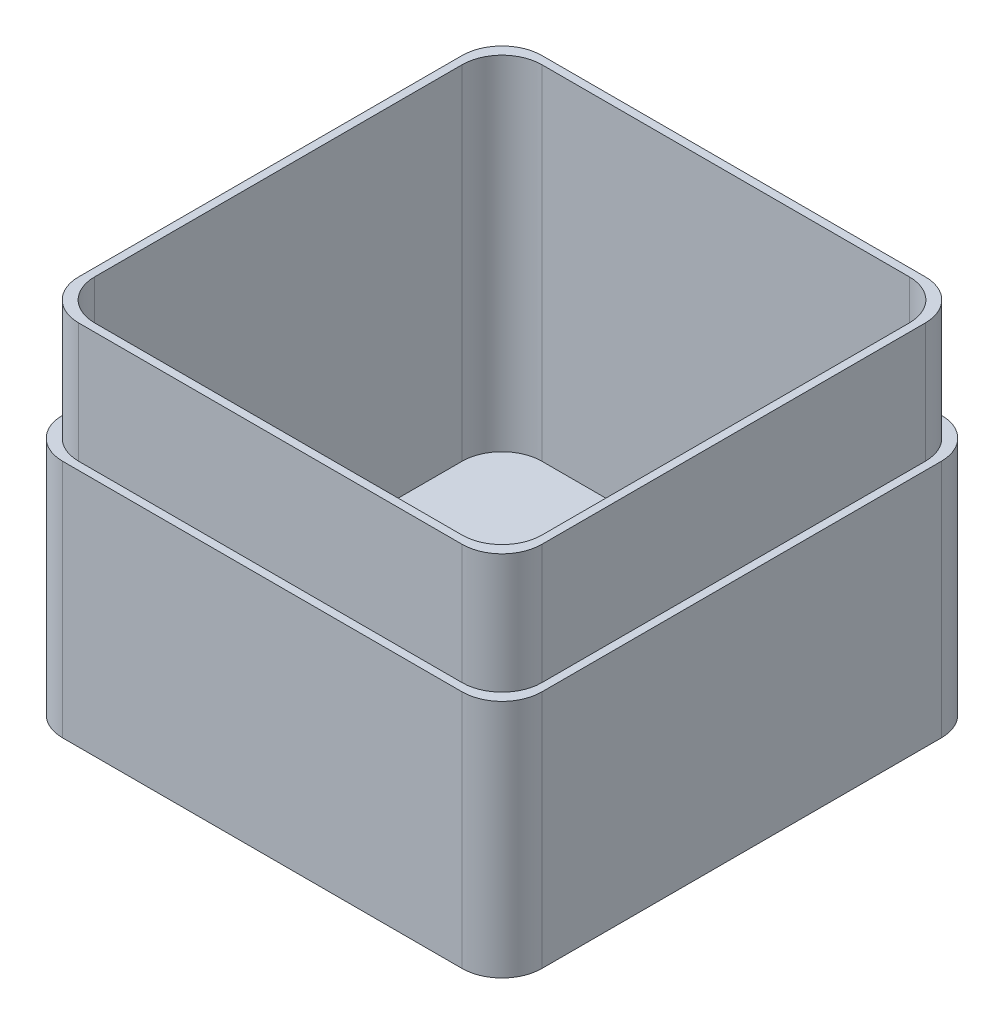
ISO-10303-21;
HEADER;
FILE_DESCRIPTION(('STEP AP214'),'2;1');
FILE_NAME('part.step','',(''),(''),'','','');
FILE_SCHEMA(('AUTOMOTIVE_DESIGN { 1 0 10303 214 1 1 1 1 }'));
ENDSEC;
DATA;
#1=APPLICATION_CONTEXT('core data for automotive mechanical design processes');
#2=APPLICATION_PROTOCOL_DEFINITION('international standard','automotive_design',2000,#1);
#3=PRODUCT_CONTEXT('',#1,'mechanical');
#4=PRODUCT('Part','Part','',(#3));
#5=PRODUCT_RELATED_PRODUCT_CATEGORY('part','',(#4));
#6=PRODUCT_DEFINITION_FORMATION('','',#4);
#7=PRODUCT_DEFINITION_CONTEXT('part definition',#1,'design');
#8=PRODUCT_DEFINITION('design','',#6,#7);
#9=PRODUCT_DEFINITION_SHAPE('','',#8);
#10=(LENGTH_UNIT() NAMED_UNIT(*) SI_UNIT(.MILLI.,.METRE.));
#11=(NAMED_UNIT(*) PLANE_ANGLE_UNIT() SI_UNIT($,.RADIAN.));
#12=(NAMED_UNIT(*) SI_UNIT($,.STERADIAN.) SOLID_ANGLE_UNIT());
#13=UNCERTAINTY_MEASURE_WITH_UNIT(LENGTH_MEASURE(1.E-05),#10,'distance_accuracy_value','');
#14=(GEOMETRIC_REPRESENTATION_CONTEXT(3) GLOBAL_UNCERTAINTY_ASSIGNED_CONTEXT((#13)) GLOBAL_UNIT_ASSIGNED_CONTEXT((#10,
#11,#12)) REPRESENTATION_CONTEXT('',''));
#15=CARTESIAN_POINT('',(0.,0.,0.));
#16=DIRECTION('',(0.,0.,1.));
#17=DIRECTION('',(1.,0.,0.));
#18=AXIS2_PLACEMENT_3D('',#15,#16,#17);
#19=CARTESIAN_POINT('',(0.,90.,0.));
#20=DIRECTION('',(0.,1.,0.));
#21=DIRECTION('',(0.,0.,1.));
#22=AXIS2_PLACEMENT_3D('',#19,#20,#21);
#23=PLANE('',#22);
#24=DIRECTION('',(0.,0.,-1.));
#25=VECTOR('',#24,1.);
#26=CARTESIAN_POINT('',(56.,90.,-60.));
#27=LINE('',#26,#25);
#28=CARTESIAN_POINT('',(56.,90.,46.));
#29=VERTEX_POINT('',#28);
#30=CARTESIAN_POINT('',(56.,90.,-46.));
#31=VERTEX_POINT('',#30);
#32=EDGE_CURVE('E472',#29,#31,#27,.T.);
#33=ORIENTED_EDGE('',*,*,#32,.F.);
#34=CARTESIAN_POINT('',(46.,90.,46.));
#35=DIRECTION('',(0.,1.,0.));
#36=DIRECTION('',(0.,0.,1.));
#37=AXIS2_PLACEMENT_3D('',#34,#35,#36);
#38=CIRCLE('',#37,10.);
#39=CARTESIAN_POINT('',(46.,90.,56.));
#40=VERTEX_POINT('',#39);
#41=EDGE_CURVE('E364',#29,#40,#38,.F.);
#42=ORIENTED_EDGE('',*,*,#41,.T.);
#43=DIRECTION('',(1.,0.,0.));
#44=VECTOR('',#43,1.);
#45=CARTESIAN_POINT('',(-60.,90.,56.));
#46=LINE('',#45,#44);
#47=CARTESIAN_POINT('',(-46.,90.,56.));
#48=VERTEX_POINT('',#47);
#49=EDGE_CURVE('E435',#48,#40,#46,.T.);
#50=ORIENTED_EDGE('',*,*,#49,.F.);
#51=CARTESIAN_POINT('',(-46.,90.,46.));
#52=DIRECTION('',(0.,1.,0.));
#53=DIRECTION('',(0.,0.,1.));
#54=AXIS2_PLACEMENT_3D('',#51,#52,#53);
#55=CIRCLE('',#54,10.);
#56=CARTESIAN_POINT('',(-56.,90.,46.));
#57=VERTEX_POINT('',#56);
#58=EDGE_CURVE('E361',#48,#57,#55,.F.);
#59=ORIENTED_EDGE('',*,*,#58,.T.);
#60=DIRECTION('',(0.,0.,1.));
#61=VECTOR('',#60,1.);
#62=CARTESIAN_POINT('',(-56.,90.,-60.));
#63=LINE('',#62,#61);
#64=CARTESIAN_POINT('',(-56.,90.,-46.));
#65=VERTEX_POINT('',#64);
#66=EDGE_CURVE('E442',#65,#57,#63,.T.);
#67=ORIENTED_EDGE('',*,*,#66,.F.);
#68=CARTESIAN_POINT('',(-46.,90.,-46.));
#69=DIRECTION('',(0.,1.,0.));
#70=DIRECTION('',(0.,0.,1.));
#71=AXIS2_PLACEMENT_3D('',#68,#69,#70);
#72=CIRCLE('',#71,10.);
#73=CARTESIAN_POINT('',(-46.,90.,-56.));
#74=VERTEX_POINT('',#73);
#75=EDGE_CURVE('E85',#65,#74,#72,.F.);
#76=ORIENTED_EDGE('',*,*,#75,.T.);
#77=DIRECTION('',(-1.,0.,0.));
#78=VECTOR('',#77,1.);
#79=CARTESIAN_POINT('',(-60.,90.,-56.));
#80=LINE('',#79,#78);
#81=CARTESIAN_POINT('',(46.,90.,-56.));
#82=VERTEX_POINT('',#81);
#83=EDGE_CURVE('E476',#82,#74,#80,.T.);
#84=ORIENTED_EDGE('',*,*,#83,.F.);
#85=CARTESIAN_POINT('',(46.,90.,-46.));
#86=DIRECTION('',(0.,1.,0.));
#87=DIRECTION('',(0.,0.,1.));
#88=AXIS2_PLACEMENT_3D('',#85,#86,#87);
#89=CIRCLE('',#88,10.);
#90=EDGE_CURVE('E381',#82,#31,#89,.F.);
#91=ORIENTED_EDGE('',*,*,#90,.T.);
#92=EDGE_LOOP('',(#33,#42,#50,#59,#67,#76,#84,#91));
#93=FACE_BOUND('',#92,.T.);
#94=DIRECTION('',(-1.,0.,0.));
#95=VECTOR('',#94,1.);
#96=CARTESIAN_POINT('',(-58.,90.,-58.));
#97=LINE('',#96,#95);
#98=CARTESIAN_POINT('',(48.,90.,-58.));
#99=VERTEX_POINT('',#98);
#100=CARTESIAN_POINT('',(-48.,90.,-58.));
#101=VERTEX_POINT('',#100);
#102=EDGE_CURVE('E505',#99,#101,#97,.T.);
#103=ORIENTED_EDGE('',*,*,#102,.T.);
#104=CARTESIAN_POINT('',(-48.,90.,-48.));
#105=DIRECTION('',(0.,1.,0.));
#106=DIRECTION('',(0.,0.,1.));
#107=AXIS2_PLACEMENT_3D('',#104,#105,#106);
#108=CIRCLE('',#107,10.);
#109=CARTESIAN_POINT('',(-58.,90.,-48.));
#110=VERTEX_POINT('',#109);
#111=EDGE_CURVE('E393',#101,#110,#108,.T.);
#112=ORIENTED_EDGE('',*,*,#111,.T.);
#113=DIRECTION('',(0.,0.,1.));
#114=VECTOR('',#113,1.);
#115=CARTESIAN_POINT('',(-58.,90.,-58.));
#116=LINE('',#115,#114);
#117=CARTESIAN_POINT('',(-58.,90.,48.));
#118=VERTEX_POINT('',#117);
#119=EDGE_CURVE('E512',#110,#118,#116,.T.);
#120=ORIENTED_EDGE('',*,*,#119,.T.);
#121=CARTESIAN_POINT('',(-48.,90.,48.));
#122=DIRECTION('',(0.,1.,0.));
#123=DIRECTION('',(0.,0.,1.));
#124=AXIS2_PLACEMENT_3D('',#121,#122,#123);
#125=CIRCLE('',#124,10.);
#126=CARTESIAN_POINT('',(-48.,90.,58.));
#127=VERTEX_POINT('',#126);
#128=EDGE_CURVE('E384',#118,#127,#125,.T.);
#129=ORIENTED_EDGE('',*,*,#128,.T.);
#130=DIRECTION('',(1.,0.,0.));
#131=VECTOR('',#130,1.);
#132=CARTESIAN_POINT('',(-58.,90.,58.));
#133=LINE('',#132,#131);
#134=CARTESIAN_POINT('',(48.,90.,58.));
#135=VERTEX_POINT('',#134);
#136=EDGE_CURVE('E517',#127,#135,#133,.T.);
#137=ORIENTED_EDGE('',*,*,#136,.T.);
#138=CARTESIAN_POINT('',(48.,90.,48.));
#139=DIRECTION('',(0.,1.,0.));
#140=DIRECTION('',(0.,0.,1.));
#141=AXIS2_PLACEMENT_3D('',#138,#139,#140);
#142=CIRCLE('',#141,10.);
#143=CARTESIAN_POINT('',(58.,90.,48.));
#144=VERTEX_POINT('',#143);
#145=EDGE_CURVE('E387',#135,#144,#142,.T.);
#146=ORIENTED_EDGE('',*,*,#145,.T.);
#147=DIRECTION('',(0.,0.,-1.));
#148=VECTOR('',#147,1.);
#149=CARTESIAN_POINT('',(58.,90.,-58.));
#150=LINE('',#149,#148);
#151=CARTESIAN_POINT('',(58.,90.,-48.));
#152=VERTEX_POINT('',#151);
#153=EDGE_CURVE('E513',#144,#152,#150,.T.);
#154=ORIENTED_EDGE('',*,*,#153,.T.);
#155=CARTESIAN_POINT('',(48.,90.,-48.));
#156=DIRECTION('',(0.,1.,0.));
#157=DIRECTION('',(0.,0.,1.));
#158=AXIS2_PLACEMENT_3D('',#155,#156,#157);
#159=CIRCLE('',#158,10.);
#160=EDGE_CURVE('E390',#152,#99,#159,.T.);
#161=ORIENTED_EDGE('',*,*,#160,.T.);
#162=EDGE_LOOP('',(#103,#112,#120,#129,#137,#146,#154,#161));
#163=FACE_BOUND('',#162,.T.);
#164=ADVANCED_FACE('F69',(#93,#163),#23,.T.);
#165=CARTESIAN_POINT('',(56.,90.,-60.));
#166=DIRECTION('',(-1.,0.,0.));
#167=DIRECTION('',(0.,0.,1.));
#168=AXIS2_PLACEMENT_3D('',#165,#166,#167);
#169=PLANE('',#168);
#170=DIRECTION('',(0.,0.,-1.));
#171=VECTOR('',#170,1.);
#172=CARTESIAN_POINT('',(56.,4.,-60.));
#173=LINE('',#172,#171);
#174=CARTESIAN_POINT('',(56.,4.,46.));
#175=VERTEX_POINT('',#174);
#176=CARTESIAN_POINT('',(56.,4.,-46.));
#177=VERTEX_POINT('',#176);
#178=EDGE_CURVE('E460',#175,#177,#173,.T.);
#179=ORIENTED_EDGE('',*,*,#178,.F.);
#180=DIRECTION('',(0.,-1.,0.));
#181=VECTOR('',#180,1.);
#182=CARTESIAN_POINT('',(56.,90.,46.));
#183=LINE('',#182,#181);
#184=EDGE_CURVE('E285',#175,#29,#183,.F.);
#185=ORIENTED_EDGE('',*,*,#184,.T.);
#186=ORIENTED_EDGE('',*,*,#32,.T.);
#187=DIRECTION('',(0.,-1.,0.));
#188=VECTOR('',#187,1.);
#189=CARTESIAN_POINT('',(56.,4.,-46.));
#190=LINE('',#189,#188);
#191=EDGE_CURVE('E281',#31,#177,#190,.T.);
#192=ORIENTED_EDGE('',*,*,#191,.T.);
#193=EDGE_LOOP('',(#179,#185,#186,#192));
#194=FACE_BOUND('',#193,.T.);
#195=ADVANCED_FACE('F494',(#194),#169,.T.);
#196=CARTESIAN_POINT('',(-60.,90.,-56.));
#197=DIRECTION('',(0.,0.,1.));
#198=DIRECTION('',(1.,0.,0.));
#199=AXIS2_PLACEMENT_3D('',#196,#197,#198);
#200=PLANE('',#199);
#201=ORIENTED_EDGE('',*,*,#83,.T.);
#202=DIRECTION('',(0.,-1.,0.));
#203=VECTOR('',#202,1.);
#204=CARTESIAN_POINT('',(-46.,4.,-56.));
#205=LINE('',#204,#203);
#206=CARTESIAN_POINT('',(-46.,4.,-56.));
#207=VERTEX_POINT('',#206);
#208=EDGE_CURVE('E358',#74,#207,#205,.T.);
#209=ORIENTED_EDGE('',*,*,#208,.T.);
#210=DIRECTION('',(-1.,0.,0.));
#211=VECTOR('',#210,1.);
#212=CARTESIAN_POINT('',(-60.,4.,-56.));
#213=LINE('',#212,#211);
#214=CARTESIAN_POINT('',(46.,4.,-56.));
#215=VERTEX_POINT('',#214);
#216=EDGE_CURVE('E236',#215,#207,#213,.T.);
#217=ORIENTED_EDGE('',*,*,#216,.F.);
#218=DIRECTION('',(0.,-1.,0.));
#219=VECTOR('',#218,1.);
#220=CARTESIAN_POINT('',(46.,90.,-56.));
#221=LINE('',#220,#219);
#222=EDGE_CURVE('E92',#215,#82,#221,.F.);
#223=ORIENTED_EDGE('',*,*,#222,.T.);
#224=EDGE_LOOP('',(#201,#209,#217,#223));
#225=FACE_BOUND('',#224,.T.);
#226=ADVANCED_FACE('F499',(#225),#200,.T.);
#227=CARTESIAN_POINT('',(-56.,90.,-60.));
#228=DIRECTION('',(1.,0.,0.));
#229=DIRECTION('',(0.,0.,-1.));
#230=AXIS2_PLACEMENT_3D('',#227,#228,#229);
#231=PLANE('',#230);
#232=ORIENTED_EDGE('',*,*,#66,.T.);
#233=DIRECTION('',(0.,-1.,0.));
#234=VECTOR('',#233,1.);
#235=CARTESIAN_POINT('',(-56.,4.,46.));
#236=LINE('',#235,#234);
#237=CARTESIAN_POINT('',(-56.,4.,46.));
#238=VERTEX_POINT('',#237);
#239=EDGE_CURVE('E251',#57,#238,#236,.T.);
#240=ORIENTED_EDGE('',*,*,#239,.T.);
#241=DIRECTION('',(0.,0.,1.));
#242=VECTOR('',#241,1.);
#243=CARTESIAN_POINT('',(-56.,4.,-60.));
#244=LINE('',#243,#242);
#245=CARTESIAN_POINT('',(-56.,4.,-46.));
#246=VERTEX_POINT('',#245);
#247=EDGE_CURVE('E235',#246,#238,#244,.T.);
#248=ORIENTED_EDGE('',*,*,#247,.F.);
#249=DIRECTION('',(0.,-1.,0.));
#250=VECTOR('',#249,1.);
#251=CARTESIAN_POINT('',(-56.,90.,-46.));
#252=LINE('',#251,#250);
#253=EDGE_CURVE('E249',#246,#65,#252,.F.);
#254=ORIENTED_EDGE('',*,*,#253,.T.);
#255=EDGE_LOOP('',(#232,#240,#248,#254));
#256=FACE_BOUND('',#255,.T.);
#257=ADVANCED_FACE('F248',(#256),#231,.T.);
#258=CARTESIAN_POINT('',(-60.,90.,56.));
#259=DIRECTION('',(0.,0.,-1.));
#260=DIRECTION('',(-1.,0.,0.));
#261=AXIS2_PLACEMENT_3D('',#258,#259,#260);
#262=PLANE('',#261);
#263=DIRECTION('',(1.,0.,0.));
#264=VECTOR('',#263,1.);
#265=CARTESIAN_POINT('',(-60.,4.,56.));
#266=LINE('',#265,#264);
#267=CARTESIAN_POINT('',(-46.,4.,56.));
#268=VERTEX_POINT('',#267);
#269=CARTESIAN_POINT('',(46.,4.,56.));
#270=VERTEX_POINT('',#269);
#271=EDGE_CURVE('E253',#268,#270,#266,.T.);
#272=ORIENTED_EDGE('',*,*,#271,.F.);
#273=DIRECTION('',(0.,-1.,0.));
#274=VECTOR('',#273,1.);
#275=CARTESIAN_POINT('',(-46.,90.,56.));
#276=LINE('',#275,#274);
#277=EDGE_CURVE('E278',#268,#48,#276,.F.);
#278=ORIENTED_EDGE('',*,*,#277,.T.);
#279=ORIENTED_EDGE('',*,*,#49,.T.);
#280=DIRECTION('',(0.,-1.,0.));
#281=VECTOR('',#280,1.);
#282=CARTESIAN_POINT('',(46.,4.,56.));
#283=LINE('',#282,#281);
#284=EDGE_CURVE('E274',#40,#270,#283,.T.);
#285=ORIENTED_EDGE('',*,*,#284,.T.);
#286=EDGE_LOOP('',(#272,#278,#279,#285));
#287=FACE_BOUND('',#286,.T.);
#288=ADVANCED_FACE('F485',(#287),#262,.T.);
#289=CARTESIAN_POINT('',(0.,4.,0.));
#290=DIRECTION('',(0.,1.,0.));
#291=DIRECTION('',(0.,0.,1.));
#292=AXIS2_PLACEMENT_3D('',#289,#290,#291);
#293=PLANE('',#292);
#294=ORIENTED_EDGE('',*,*,#247,.T.);
#295=CARTESIAN_POINT('',(-46.,4.,46.));
#296=DIRECTION('',(0.,1.,0.));
#297=DIRECTION('',(0.,0.,1.));
#298=AXIS2_PLACEMENT_3D('',#295,#296,#297);
#299=CIRCLE('',#298,10.);
#300=EDGE_CURVE('E271',#238,#268,#299,.T.);
#301=ORIENTED_EDGE('',*,*,#300,.T.);
#302=ORIENTED_EDGE('',*,*,#271,.T.);
#303=CARTESIAN_POINT('',(46.,4.,46.));
#304=DIRECTION('',(0.,1.,0.));
#305=DIRECTION('',(0.,0.,1.));
#306=AXIS2_PLACEMENT_3D('',#303,#304,#305);
#307=CIRCLE('',#306,10.);
#308=EDGE_CURVE('E242',#270,#175,#307,.T.);
#309=ORIENTED_EDGE('',*,*,#308,.T.);
#310=ORIENTED_EDGE('',*,*,#178,.T.);
#311=CARTESIAN_POINT('',(46.,4.,-46.));
#312=DIRECTION('',(0.,1.,0.));
#313=DIRECTION('',(0.,0.,1.));
#314=AXIS2_PLACEMENT_3D('',#311,#312,#313);
#315=CIRCLE('',#314,10.);
#316=EDGE_CURVE('E243',#177,#215,#315,.T.);
#317=ORIENTED_EDGE('',*,*,#316,.T.);
#318=ORIENTED_EDGE('',*,*,#216,.T.);
#319=CARTESIAN_POINT('',(-46.,4.,-46.));
#320=DIRECTION('',(0.,1.,0.));
#321=DIRECTION('',(0.,0.,1.));
#322=AXIS2_PLACEMENT_3D('',#319,#320,#321);
#323=CIRCLE('',#322,10.);
#324=EDGE_CURVE('E232',#207,#246,#323,.T.);
#325=ORIENTED_EDGE('',*,*,#324,.T.);
#326=EDGE_LOOP('',(#294,#301,#302,#309,#310,#317,#318,#325));
#327=FACE_BOUND('',#326,.T.);
#328=ADVANCED_FACE('F234',(#327),#293,.T.);
#329=CARTESIAN_POINT('',(0.,60.,0.));
#330=DIRECTION('',(0.,1.,0.));
#331=DIRECTION('',(0.,0.,1.));
#332=AXIS2_PLACEMENT_3D('',#329,#330,#331);
#333=PLANE('',#332);
#334=DIRECTION('',(1.,0.,0.));
#335=VECTOR('',#334,1.);
#336=CARTESIAN_POINT('',(-58.,60.,58.));
#337=LINE('',#336,#335);
#338=CARTESIAN_POINT('',(-48.,60.,58.));
#339=VERTEX_POINT('',#338);
#340=CARTESIAN_POINT('',(48.,60.,58.));
#341=VERTEX_POINT('',#340);
#342=EDGE_CURVE('E527',#339,#341,#337,.T.);
#343=ORIENTED_EDGE('',*,*,#342,.F.);
#344=CARTESIAN_POINT('',(-48.,60.,48.));
#345=DIRECTION('',(0.,1.,0.));
#346=DIRECTION('',(0.,0.,1.));
#347=AXIS2_PLACEMENT_3D('',#344,#345,#346);
#348=CIRCLE('',#347,10.);
#349=CARTESIAN_POINT('',(-58.,60.,48.));
#350=VERTEX_POINT('',#349);
#351=EDGE_CURVE('E376',#339,#350,#348,.F.);
#352=ORIENTED_EDGE('',*,*,#351,.T.);
#353=DIRECTION('',(0.,0.,1.));
#354=VECTOR('',#353,1.);
#355=CARTESIAN_POINT('',(-58.,60.,-58.));
#356=LINE('',#355,#354);
#357=CARTESIAN_POINT('',(-58.,60.,-48.));
#358=VERTEX_POINT('',#357);
#359=EDGE_CURVE('E532',#358,#350,#356,.T.);
#360=ORIENTED_EDGE('',*,*,#359,.F.);
#361=CARTESIAN_POINT('',(-48.,60.,-48.));
#362=DIRECTION('',(0.,1.,0.));
#363=DIRECTION('',(0.,0.,1.));
#364=AXIS2_PLACEMENT_3D('',#361,#362,#363);
#365=CIRCLE('',#364,10.);
#366=CARTESIAN_POINT('',(-48.,60.,-58.));
#367=VERTEX_POINT('',#366);
#368=EDGE_CURVE('E367',#358,#367,#365,.F.);
#369=ORIENTED_EDGE('',*,*,#368,.T.);
#370=DIRECTION('',(-1.,0.,0.));
#371=VECTOR('',#370,1.);
#372=CARTESIAN_POINT('',(-58.,60.,-58.));
#373=LINE('',#372,#371);
#374=CARTESIAN_POINT('',(48.,60.,-58.));
#375=VERTEX_POINT('',#374);
#376=EDGE_CURVE('E538',#375,#367,#373,.T.);
#377=ORIENTED_EDGE('',*,*,#376,.F.);
#378=CARTESIAN_POINT('',(48.,60.,-48.));
#379=DIRECTION('',(0.,1.,0.));
#380=DIRECTION('',(0.,0.,1.));
#381=AXIS2_PLACEMENT_3D('',#378,#379,#380);
#382=CIRCLE('',#381,10.);
#383=CARTESIAN_POINT('',(58.,60.,-48.));
#384=VERTEX_POINT('',#383);
#385=EDGE_CURVE('E370',#375,#384,#382,.F.);
#386=ORIENTED_EDGE('',*,*,#385,.T.);
#387=DIRECTION('',(0.,0.,-1.));
#388=VECTOR('',#387,1.);
#389=CARTESIAN_POINT('',(58.,60.,-58.));
#390=LINE('',#389,#388);
#391=CARTESIAN_POINT('',(58.,60.,48.));
#392=VERTEX_POINT('',#391);
#393=EDGE_CURVE('E524',#392,#384,#390,.T.);
#394=ORIENTED_EDGE('',*,*,#393,.F.);
#395=CARTESIAN_POINT('',(48.,60.,48.));
#396=DIRECTION('',(0.,1.,0.));
#397=DIRECTION('',(0.,0.,1.));
#398=AXIS2_PLACEMENT_3D('',#395,#396,#397);
#399=CIRCLE('',#398,10.);
#400=EDGE_CURVE('E373',#392,#341,#399,.F.);
#401=ORIENTED_EDGE('',*,*,#400,.T.);
#402=EDGE_LOOP('',(#343,#352,#360,#369,#377,#386,#394,#401));
#403=FACE_BOUND('',#402,.T.);
#404=DIRECTION('',(-1.,0.,0.));
#405=VECTOR('',#404,1.);
#406=CARTESIAN_POINT('',(-60.,60.,-60.));
#407=LINE('',#406,#405);
#408=CARTESIAN_POINT('',(50.,60.,-60.));
#409=VERTEX_POINT('',#408);
#410=CARTESIAN_POINT('',(-50.,60.,-60.));
#411=VERTEX_POINT('',#410);
#412=EDGE_CURVE('E408',#409,#411,#407,.T.);
#413=ORIENTED_EDGE('',*,*,#412,.T.);
#414=CARTESIAN_POINT('',(-50.,60.,-50.));
#415=DIRECTION('',(0.,1.,0.));
#416=DIRECTION('',(0.,0.,1.));
#417=AXIS2_PLACEMENT_3D('',#414,#415,#416);
#418=CIRCLE('',#417,10.);
#419=CARTESIAN_POINT('',(-60.,60.,-50.));
#420=VERTEX_POINT('',#419);
#421=EDGE_CURVE('E12',#411,#420,#418,.T.);
#422=ORIENTED_EDGE('',*,*,#421,.T.);
#423=DIRECTION('',(0.,0.,1.));
#424=VECTOR('',#423,1.);
#425=CARTESIAN_POINT('',(-60.,60.,-60.));
#426=LINE('',#425,#424);
#427=CARTESIAN_POINT('',(-60.,60.,50.));
#428=VERTEX_POINT('',#427);
#429=EDGE_CURVE('E421',#420,#428,#426,.T.);
#430=ORIENTED_EDGE('',*,*,#429,.T.);
#431=CARTESIAN_POINT('',(-50.,60.,50.));
#432=DIRECTION('',(0.,1.,0.));
#433=DIRECTION('',(0.,0.,1.));
#434=AXIS2_PLACEMENT_3D('',#431,#432,#433);
#435=CIRCLE('',#434,10.);
#436=CARTESIAN_POINT('',(-50.,60.,60.));
#437=VERTEX_POINT('',#436);
#438=EDGE_CURVE('E396',#428,#437,#435,.T.);
#439=ORIENTED_EDGE('',*,*,#438,.T.);
#440=DIRECTION('',(1.,0.,0.));
#441=VECTOR('',#440,1.);
#442=CARTESIAN_POINT('',(-60.,60.,60.));
#443=LINE('',#442,#441);
#444=CARTESIAN_POINT('',(50.,60.,60.));
#445=VERTEX_POINT('',#444);
#446=EDGE_CURVE('E257',#437,#445,#443,.T.);
#447=ORIENTED_EDGE('',*,*,#446,.T.);
#448=CARTESIAN_POINT('',(50.,60.,50.));
#449=DIRECTION('',(0.,1.,0.));
#450=DIRECTION('',(0.,0.,1.));
#451=AXIS2_PLACEMENT_3D('',#448,#449,#450);
#452=CIRCLE('',#451,10.);
#453=CARTESIAN_POINT('',(60.,60.,50.));
#454=VERTEX_POINT('',#453);
#455=EDGE_CURVE('E399',#445,#454,#452,.T.);
#456=ORIENTED_EDGE('',*,*,#455,.T.);
#457=DIRECTION('',(0.,0.,-1.));
#458=VECTOR('',#457,1.);
#459=CARTESIAN_POINT('',(60.,60.,-60.));
#460=LINE('',#459,#458);
#461=CARTESIAN_POINT('',(60.,60.,-50.));
#462=VERTEX_POINT('',#461);
#463=EDGE_CURVE('E411',#454,#462,#460,.T.);
#464=ORIENTED_EDGE('',*,*,#463,.T.);
#465=CARTESIAN_POINT('',(50.,60.,-50.));
#466=DIRECTION('',(0.,1.,0.));
#467=DIRECTION('',(0.,0.,1.));
#468=AXIS2_PLACEMENT_3D('',#465,#466,#467);
#469=CIRCLE('',#468,10.);
#470=EDGE_CURVE('E78',#462,#409,#469,.T.);
#471=ORIENTED_EDGE('',*,*,#470,.T.);
#472=EDGE_LOOP('',(#413,#422,#430,#439,#447,#456,#464,#471));
#473=FACE_BOUND('',#472,.T.);
#474=ADVANCED_FACE('F407',(#403,#473),#333,.T.);
#475=CARTESIAN_POINT('',(58.,60.,-58.));
#476=DIRECTION('',(1.,0.,0.));
#477=DIRECTION('',(0.,0.,-1.));
#478=AXIS2_PLACEMENT_3D('',#475,#476,#477);
#479=PLANE('',#478);
#480=ORIENTED_EDGE('',*,*,#393,.T.);
#481=DIRECTION('',(0.,1.,0.));
#482=VECTOR('',#481,1.);
#483=CARTESIAN_POINT('',(58.,60.,-48.));
#484=LINE('',#483,#482);
#485=EDGE_CURVE('E331',#384,#152,#484,.T.);
#486=ORIENTED_EDGE('',*,*,#485,.T.);
#487=ORIENTED_EDGE('',*,*,#153,.F.);
#488=DIRECTION('',(0.,1.,0.));
#489=VECTOR('',#488,1.);
#490=CARTESIAN_POINT('',(58.,60.,48.));
#491=LINE('',#490,#489);
#492=EDGE_CURVE('E328',#144,#392,#491,.F.);
#493=ORIENTED_EDGE('',*,*,#492,.T.);
#494=EDGE_LOOP('',(#480,#486,#487,#493));
#495=FACE_BOUND('',#494,.T.);
#496=ADVANCED_FACE('F549',(#495),#479,.T.);
#497=CARTESIAN_POINT('',(-58.,60.,58.));
#498=DIRECTION('',(0.,0.,1.));
#499=DIRECTION('',(1.,0.,0.));
#500=AXIS2_PLACEMENT_3D('',#497,#498,#499);
#501=PLANE('',#500);
#502=ORIENTED_EDGE('',*,*,#342,.T.);
#503=DIRECTION('',(0.,1.,0.));
#504=VECTOR('',#503,1.);
#505=CARTESIAN_POINT('',(48.,60.,58.));
#506=LINE('',#505,#504);
#507=EDGE_CURVE('E352',#341,#135,#506,.T.);
#508=ORIENTED_EDGE('',*,*,#507,.T.);
#509=ORIENTED_EDGE('',*,*,#136,.F.);
#510=DIRECTION('',(0.,1.,0.));
#511=VECTOR('',#510,1.);
#512=CARTESIAN_POINT('',(-48.,60.,58.));
#513=LINE('',#512,#511);
#514=EDGE_CURVE('E349',#127,#339,#513,.F.);
#515=ORIENTED_EDGE('',*,*,#514,.T.);
#516=EDGE_LOOP('',(#502,#508,#509,#515));
#517=FACE_BOUND('',#516,.T.);
#518=ADVANCED_FACE('F571',(#517),#501,.T.);
#519=CARTESIAN_POINT('',(-58.,60.,-58.));
#520=DIRECTION('',(-1.,0.,0.));
#521=DIRECTION('',(0.,0.,1.));
#522=AXIS2_PLACEMENT_3D('',#519,#520,#521);
#523=PLANE('',#522);
#524=ORIENTED_EDGE('',*,*,#119,.F.);
#525=DIRECTION('',(0.,1.,0.));
#526=VECTOR('',#525,1.);
#527=CARTESIAN_POINT('',(-58.,60.,-48.));
#528=LINE('',#527,#526);
#529=EDGE_CURVE('E299',#110,#358,#528,.F.);
#530=ORIENTED_EDGE('',*,*,#529,.T.);
#531=ORIENTED_EDGE('',*,*,#359,.T.);
#532=DIRECTION('',(0.,1.,0.));
#533=VECTOR('',#532,1.);
#534=CARTESIAN_POINT('',(-58.,60.,48.));
#535=LINE('',#534,#533);
#536=EDGE_CURVE('E295',#350,#118,#535,.T.);
#537=ORIENTED_EDGE('',*,*,#536,.T.);
#538=EDGE_LOOP('',(#524,#530,#531,#537));
#539=FACE_BOUND('',#538,.T.);
#540=ADVANCED_FACE('F566',(#539),#523,.T.);
#541=CARTESIAN_POINT('',(-58.,60.,-58.));
#542=DIRECTION('',(0.,0.,-1.));
#543=DIRECTION('',(-1.,0.,0.));
#544=AXIS2_PLACEMENT_3D('',#541,#542,#543);
#545=PLANE('',#544);
#546=ORIENTED_EDGE('',*,*,#376,.T.);
#547=DIRECTION('',(0.,1.,0.));
#548=VECTOR('',#547,1.);
#549=CARTESIAN_POINT('',(-48.,60.,-58.));
#550=LINE('',#549,#548);
#551=EDGE_CURVE('E291',#367,#101,#550,.T.);
#552=ORIENTED_EDGE('',*,*,#551,.T.);
#553=ORIENTED_EDGE('',*,*,#102,.F.);
#554=DIRECTION('',(0.,1.,0.));
#555=VECTOR('',#554,1.);
#556=CARTESIAN_POINT('',(48.,60.,-58.));
#557=LINE('',#556,#555);
#558=EDGE_CURVE('E288',#99,#375,#557,.F.);
#559=ORIENTED_EDGE('',*,*,#558,.T.);
#560=EDGE_LOOP('',(#546,#552,#553,#559));
#561=FACE_BOUND('',#560,.T.);
#562=ADVANCED_FACE('F558',(#561),#545,.T.);
#563=CARTESIAN_POINT('',(0.,0.,0.));
#564=DIRECTION('',(0.,1.,0.));
#565=DIRECTION('',(0.,0.,1.));
#566=AXIS2_PLACEMENT_3D('',#563,#564,#565);
#567=PLANE('',#566);
#568=DIRECTION('',(0.,0.,1.));
#569=VECTOR('',#568,1.);
#570=CARTESIAN_POINT('',(-60.,0.,-60.));
#571=LINE('',#570,#569);
#572=CARTESIAN_POINT('',(-60.,0.,-50.));
#573=VERTEX_POINT('',#572);
#574=CARTESIAN_POINT('',(-60.,0.,50.));
#575=VERTEX_POINT('',#574);
#576=EDGE_CURVE('E439',#573,#575,#571,.T.);
#577=ORIENTED_EDGE('',*,*,#576,.F.);
#578=CARTESIAN_POINT('',(-50.,0.,-50.));
#579=DIRECTION('',(0.,1.,0.));
#580=DIRECTION('',(0.,0.,1.));
#581=AXIS2_PLACEMENT_3D('',#578,#579,#580);
#582=CIRCLE('',#581,10.);
#583=CARTESIAN_POINT('',(-50.,0.,-60.));
#584=VERTEX_POINT('',#583);
#585=EDGE_CURVE('E318',#573,#584,#582,.F.);
#586=ORIENTED_EDGE('',*,*,#585,.T.);
#587=DIRECTION('',(-1.,0.,0.));
#588=VECTOR('',#587,1.);
#589=CARTESIAN_POINT('',(-60.,0.,-60.));
#590=LINE('',#589,#588);
#591=CARTESIAN_POINT('',(50.,0.,-60.));
#592=VERTEX_POINT('',#591);
#593=EDGE_CURVE('E430',#592,#584,#590,.T.);
#594=ORIENTED_EDGE('',*,*,#593,.F.);
#595=CARTESIAN_POINT('',(50.,0.,-50.));
#596=DIRECTION('',(0.,1.,0.));
#597=DIRECTION('',(0.,0.,1.));
#598=AXIS2_PLACEMENT_3D('',#595,#596,#597);
#599=CIRCLE('',#598,10.);
#600=CARTESIAN_POINT('',(60.,0.,-50.));
#601=VERTEX_POINT('',#600);
#602=EDGE_CURVE('E315',#592,#601,#599,.F.);
#603=ORIENTED_EDGE('',*,*,#602,.T.);
#604=DIRECTION('',(0.,0.,-1.));
#605=VECTOR('',#604,1.);
#606=CARTESIAN_POINT('',(60.,0.,-60.));
#607=LINE('',#606,#605);
#608=CARTESIAN_POINT('',(60.,0.,50.));
#609=VERTEX_POINT('',#608);
#610=EDGE_CURVE('E429',#609,#601,#607,.T.);
#611=ORIENTED_EDGE('',*,*,#610,.F.);
#612=CARTESIAN_POINT('',(50.,0.,50.));
#613=DIRECTION('',(0.,1.,0.));
#614=DIRECTION('',(0.,0.,1.));
#615=AXIS2_PLACEMENT_3D('',#612,#613,#614);
#616=CIRCLE('',#615,10.);
#617=CARTESIAN_POINT('',(50.,0.,60.));
#618=VERTEX_POINT('',#617);
#619=EDGE_CURVE('E312',#609,#618,#616,.F.);
#620=ORIENTED_EDGE('',*,*,#619,.T.);
#621=DIRECTION('',(1.,0.,0.));
#622=VECTOR('',#621,1.);
#623=CARTESIAN_POINT('',(-60.,0.,60.));
#624=LINE('',#623,#622);
#625=CARTESIAN_POINT('',(-50.,0.,60.));
#626=VERTEX_POINT('',#625);
#627=EDGE_CURVE('E263',#626,#618,#624,.T.);
#628=ORIENTED_EDGE('',*,*,#627,.F.);
#629=CARTESIAN_POINT('',(-50.,0.,50.));
#630=DIRECTION('',(0.,1.,0.));
#631=DIRECTION('',(0.,0.,1.));
#632=AXIS2_PLACEMENT_3D('',#629,#630,#631);
#633=CIRCLE('',#632,10.);
#634=EDGE_CURVE('E309',#626,#575,#633,.F.);
#635=ORIENTED_EDGE('',*,*,#634,.T.);
#636=EDGE_LOOP('',(#577,#586,#594,#603,#611,#620,#628,#635));
#637=FACE_BOUND('',#636,.T.);
#638=ADVANCED_FACE('F428',(#637),#567,.F.);
#639=CARTESIAN_POINT('',(-60.,90.,60.));
#640=DIRECTION('',(0.,0.,-1.));
#641=DIRECTION('',(-1.,0.,0.));
#642=AXIS2_PLACEMENT_3D('',#639,#640,#641);
#643=PLANE('',#642);
#644=ORIENTED_EDGE('',*,*,#627,.T.);
#645=DIRECTION('',(0.,-1.,0.));
#646=VECTOR('',#645,1.);
#647=CARTESIAN_POINT('',(50.,90.,60.));
#648=LINE('',#647,#646);
#649=EDGE_CURVE('E346',#618,#445,#648,.F.);
#650=ORIENTED_EDGE('',*,*,#649,.T.);
#651=ORIENTED_EDGE('',*,*,#446,.F.);
#652=DIRECTION('',(0.,-1.,0.));
#653=VECTOR('',#652,1.);
#654=CARTESIAN_POINT('',(-50.,90.,60.));
#655=LINE('',#654,#653);
#656=EDGE_CURVE('E342',#437,#626,#655,.T.);
#657=ORIENTED_EDGE('',*,*,#656,.T.);
#658=EDGE_LOOP('',(#644,#650,#651,#657));
#659=FACE_BOUND('',#658,.T.);
#660=ADVANCED_FACE('F453',(#659),#643,.F.);
#661=CARTESIAN_POINT('',(-60.,90.,-60.));
#662=DIRECTION('',(1.,0.,0.));
#663=DIRECTION('',(0.,0.,-1.));
#664=AXIS2_PLACEMENT_3D('',#661,#662,#663);
#665=PLANE('',#664);
#666=ORIENTED_EDGE('',*,*,#429,.F.);
#667=DIRECTION('',(0.,-1.,0.));
#668=VECTOR('',#667,1.);
#669=CARTESIAN_POINT('',(-60.,90.,-50.));
#670=LINE('',#669,#668);
#671=EDGE_CURVE('E305',#420,#573,#670,.T.);
#672=ORIENTED_EDGE('',*,*,#671,.T.);
#673=ORIENTED_EDGE('',*,*,#576,.T.);
#674=DIRECTION('',(0.,-1.,0.));
#675=VECTOR('',#674,1.);
#676=CARTESIAN_POINT('',(-60.,90.,50.));
#677=LINE('',#676,#675);
#678=EDGE_CURVE('E302',#575,#428,#677,.F.);
#679=ORIENTED_EDGE('',*,*,#678,.T.);
#680=EDGE_LOOP('',(#666,#672,#673,#679));
#681=FACE_BOUND('',#680,.T.);
#682=ADVANCED_FACE('F729',(#681),#665,.F.);
#683=CARTESIAN_POINT('',(-60.,90.,-60.));
#684=DIRECTION('',(0.,0.,1.));
#685=DIRECTION('',(1.,0.,0.));
#686=AXIS2_PLACEMENT_3D('',#683,#684,#685);
#687=PLANE('',#686);
#688=ORIENTED_EDGE('',*,*,#593,.T.);
#689=DIRECTION('',(0.,-1.,0.));
#690=VECTOR('',#689,1.);
#691=CARTESIAN_POINT('',(-50.,90.,-60.));
#692=LINE('',#691,#690);
#693=EDGE_CURVE('E325',#584,#411,#692,.F.);
#694=ORIENTED_EDGE('',*,*,#693,.T.);
#695=ORIENTED_EDGE('',*,*,#412,.F.);
#696=DIRECTION('',(0.,-1.,0.));
#697=VECTOR('',#696,1.);
#698=CARTESIAN_POINT('',(50.,90.,-60.));
#699=LINE('',#698,#697);
#700=EDGE_CURVE('E321',#409,#592,#699,.T.);
#701=ORIENTED_EDGE('',*,*,#700,.T.);
#702=EDGE_LOOP('',(#688,#694,#695,#701));
#703=FACE_BOUND('',#702,.T.);
#704=ADVANCED_FACE('F417',(#703),#687,.F.);
#705=CARTESIAN_POINT('',(60.,90.,-60.));
#706=DIRECTION('',(-1.,0.,0.));
#707=DIRECTION('',(0.,0.,1.));
#708=AXIS2_PLACEMENT_3D('',#705,#706,#707);
#709=PLANE('',#708);
#710=ORIENTED_EDGE('',*,*,#610,.T.);
#711=DIRECTION('',(0.,-1.,0.));
#712=VECTOR('',#711,1.);
#713=CARTESIAN_POINT('',(60.,90.,-50.));
#714=LINE('',#713,#712);
#715=EDGE_CURVE('E339',#601,#462,#714,.F.);
#716=ORIENTED_EDGE('',*,*,#715,.T.);
#717=ORIENTED_EDGE('',*,*,#463,.F.);
#718=DIRECTION('',(0.,-1.,0.));
#719=VECTOR('',#718,1.);
#720=CARTESIAN_POINT('',(60.,90.,50.));
#721=LINE('',#720,#719);
#722=EDGE_CURVE('E335',#454,#609,#721,.T.);
#723=ORIENTED_EDGE('',*,*,#722,.T.);
#724=EDGE_LOOP('',(#710,#716,#717,#723));
#725=FACE_BOUND('',#724,.T.);
#726=ADVANCED_FACE('F432',(#725),#709,.F.);
#727=CARTESIAN_POINT('',(-46.,90.,46.));
#728=DIRECTION('',(0.,1.,0.));
#729=DIRECTION('',(0.,0.,1.));
#730=AXIS2_PLACEMENT_3D('',#727,#728,#729);
#731=CYLINDRICAL_SURFACE('',#730,10.);
#732=ORIENTED_EDGE('',*,*,#58,.F.);
#733=ORIENTED_EDGE('',*,*,#277,.F.);
#734=ORIENTED_EDGE('',*,*,#300,.F.);
#735=ORIENTED_EDGE('',*,*,#239,.F.);
#736=EDGE_LOOP('',(#732,#733,#734,#735));
#737=FACE_BOUND('',#736,.T.);
#738=ADVANCED_FACE('F481',(#737),#731,.F.);
#739=CARTESIAN_POINT('',(46.,90.,46.));
#740=DIRECTION('',(0.,1.,0.));
#741=DIRECTION('',(0.,0.,1.));
#742=AXIS2_PLACEMENT_3D('',#739,#740,#741);
#743=CYLINDRICAL_SURFACE('',#742,10.);
#744=ORIENTED_EDGE('',*,*,#41,.F.);
#745=ORIENTED_EDGE('',*,*,#184,.F.);
#746=ORIENTED_EDGE('',*,*,#308,.F.);
#747=ORIENTED_EDGE('',*,*,#284,.F.);
#748=EDGE_LOOP('',(#744,#745,#746,#747));
#749=FACE_BOUND('',#748,.T.);
#750=ADVANCED_FACE('F490',(#749),#743,.F.);
#751=CARTESIAN_POINT('',(-48.,60.,-48.));
#752=DIRECTION('',(0.,1.,0.));
#753=DIRECTION('',(0.,0.,1.));
#754=AXIS2_PLACEMENT_3D('',#751,#752,#753);
#755=CYLINDRICAL_SURFACE('',#754,10.);
#756=ORIENTED_EDGE('',*,*,#368,.F.);
#757=ORIENTED_EDGE('',*,*,#529,.F.);
#758=ORIENTED_EDGE('',*,*,#111,.F.);
#759=ORIENTED_EDGE('',*,*,#551,.F.);
#760=EDGE_LOOP('',(#756,#757,#758,#759));
#761=FACE_BOUND('',#760,.T.);
#762=ADVANCED_FACE('F564',(#761),#755,.T.);
#763=CARTESIAN_POINT('',(-50.,90.,-50.));
#764=DIRECTION('',(0.,-1.,0.));
#765=DIRECTION('',(0.,0.,-1.));
#766=AXIS2_PLACEMENT_3D('',#763,#764,#765);
#767=CYLINDRICAL_SURFACE('',#766,10.);
#768=ORIENTED_EDGE('',*,*,#421,.F.);
#769=ORIENTED_EDGE('',*,*,#693,.F.);
#770=ORIENTED_EDGE('',*,*,#585,.F.);
#771=ORIENTED_EDGE('',*,*,#671,.F.);
#772=EDGE_LOOP('',(#768,#769,#770,#771));
#773=FACE_BOUND('',#772,.T.);
#774=ADVANCED_FACE('F638',(#773),#767,.T.);
#775=CARTESIAN_POINT('',(48.,60.,-48.));
#776=DIRECTION('',(0.,1.,0.));
#777=DIRECTION('',(0.,0.,1.));
#778=AXIS2_PLACEMENT_3D('',#775,#776,#777);
#779=CYLINDRICAL_SURFACE('',#778,10.);
#780=ORIENTED_EDGE('',*,*,#385,.F.);
#781=ORIENTED_EDGE('',*,*,#558,.F.);
#782=ORIENTED_EDGE('',*,*,#160,.F.);
#783=ORIENTED_EDGE('',*,*,#485,.F.);
#784=EDGE_LOOP('',(#780,#781,#782,#783));
#785=FACE_BOUND('',#784,.T.);
#786=ADVANCED_FACE('F556',(#785),#779,.T.);
#787=CARTESIAN_POINT('',(50.,90.,-50.));
#788=DIRECTION('',(0.,-1.,0.));
#789=DIRECTION('',(0.,0.,-1.));
#790=AXIS2_PLACEMENT_3D('',#787,#788,#789);
#791=CYLINDRICAL_SURFACE('',#790,10.);
#792=ORIENTED_EDGE('',*,*,#470,.F.);
#793=ORIENTED_EDGE('',*,*,#715,.F.);
#794=ORIENTED_EDGE('',*,*,#602,.F.);
#795=ORIENTED_EDGE('',*,*,#700,.F.);
#796=EDGE_LOOP('',(#792,#793,#794,#795));
#797=FACE_BOUND('',#796,.T.);
#798=ADVANCED_FACE('F423',(#797),#791,.T.);
#799=CARTESIAN_POINT('',(50.,90.,50.));
#800=DIRECTION('',(0.,-1.,0.));
#801=DIRECTION('',(0.,0.,-1.));
#802=AXIS2_PLACEMENT_3D('',#799,#800,#801);
#803=CYLINDRICAL_SURFACE('',#802,10.);
#804=ORIENTED_EDGE('',*,*,#455,.F.);
#805=ORIENTED_EDGE('',*,*,#649,.F.);
#806=ORIENTED_EDGE('',*,*,#619,.F.);
#807=ORIENTED_EDGE('',*,*,#722,.F.);
#808=EDGE_LOOP('',(#804,#805,#806,#807));
#809=FACE_BOUND('',#808,.T.);
#810=ADVANCED_FACE('F458',(#809),#803,.T.);
#811=CARTESIAN_POINT('',(48.,60.,48.));
#812=DIRECTION('',(0.,1.,0.));
#813=DIRECTION('',(0.,0.,1.));
#814=AXIS2_PLACEMENT_3D('',#811,#812,#813);
#815=CYLINDRICAL_SURFACE('',#814,10.);
#816=ORIENTED_EDGE('',*,*,#400,.F.);
#817=ORIENTED_EDGE('',*,*,#492,.F.);
#818=ORIENTED_EDGE('',*,*,#145,.F.);
#819=ORIENTED_EDGE('',*,*,#507,.F.);
#820=EDGE_LOOP('',(#816,#817,#818,#819));
#821=FACE_BOUND('',#820,.T.);
#822=ADVANCED_FACE('F575',(#821),#815,.T.);
#823=CARTESIAN_POINT('',(-48.,60.,48.));
#824=DIRECTION('',(0.,1.,0.));
#825=DIRECTION('',(0.,0.,1.));
#826=AXIS2_PLACEMENT_3D('',#823,#824,#825);
#827=CYLINDRICAL_SURFACE('',#826,10.);
#828=ORIENTED_EDGE('',*,*,#351,.F.);
#829=ORIENTED_EDGE('',*,*,#514,.F.);
#830=ORIENTED_EDGE('',*,*,#128,.F.);
#831=ORIENTED_EDGE('',*,*,#536,.F.);
#832=EDGE_LOOP('',(#828,#829,#830,#831));
#833=FACE_BOUND('',#832,.T.);
#834=ADVANCED_FACE('F573',(#833),#827,.T.);
#835=CARTESIAN_POINT('',(-50.,90.,50.));
#836=DIRECTION('',(0.,-1.,0.));
#837=DIRECTION('',(0.,0.,-1.));
#838=AXIS2_PLACEMENT_3D('',#835,#836,#837);
#839=CYLINDRICAL_SURFACE('',#838,10.);
#840=ORIENTED_EDGE('',*,*,#438,.F.);
#841=ORIENTED_EDGE('',*,*,#678,.F.);
#842=ORIENTED_EDGE('',*,*,#634,.F.);
#843=ORIENTED_EDGE('',*,*,#656,.F.);
#844=EDGE_LOOP('',(#840,#841,#842,#843));
#845=FACE_BOUND('',#844,.T.);
#846=ADVANCED_FACE('F582',(#845),#839,.T.);
#847=CARTESIAN_POINT('',(-46.,90.,-46.));
#848=DIRECTION('',(0.,1.,0.));
#849=DIRECTION('',(0.,0.,1.));
#850=AXIS2_PLACEMENT_3D('',#847,#848,#849);
#851=CYLINDRICAL_SURFACE('',#850,10.);
#852=ORIENTED_EDGE('',*,*,#75,.F.);
#853=ORIENTED_EDGE('',*,*,#253,.F.);
#854=ORIENTED_EDGE('',*,*,#324,.F.);
#855=ORIENTED_EDGE('',*,*,#208,.F.);
#856=EDGE_LOOP('',(#852,#853,#854,#855));
#857=FACE_BOUND('',#856,.T.);
#858=ADVANCED_FACE('F255',(#857),#851,.F.);
#859=CARTESIAN_POINT('',(46.,90.,-46.));
#860=DIRECTION('',(0.,1.,0.));
#861=DIRECTION('',(0.,0.,1.));
#862=AXIS2_PLACEMENT_3D('',#859,#860,#861);
#863=CYLINDRICAL_SURFACE('',#862,10.);
#864=ORIENTED_EDGE('',*,*,#90,.F.);
#865=ORIENTED_EDGE('',*,*,#222,.F.);
#866=ORIENTED_EDGE('',*,*,#316,.F.);
#867=ORIENTED_EDGE('',*,*,#191,.F.);
#868=EDGE_LOOP('',(#864,#865,#866,#867));
#869=FACE_BOUND('',#868,.T.);
#870=ADVANCED_FACE('F71',(#869),#863,.F.);
#871=CLOSED_SHELL('',(#164,#195,#226,#257,#288,#328,#474,#496,#518,#540,#562,#638,#660,#682,
#704,#726,#738,#750,#762,#774,#786,#798,#810,#822,#834,#846,#858,#870));
#872=MANIFOLD_SOLID_BREP('B2',#871);
#873=ADVANCED_BREP_SHAPE_REPRESENTATION('',(#18,#872),#14);
#874=SHAPE_DEFINITION_REPRESENTATION(#9,#873);
ENDSEC;
END-ISO-10303-21;
